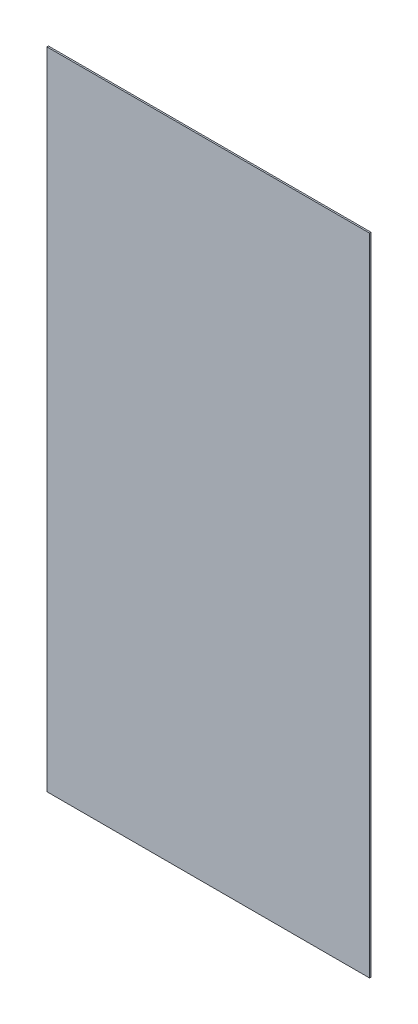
ISO-10303-21;
HEADER;
FILE_DESCRIPTION(('STEP AP214'),'2;1');
FILE_NAME('part.step','',(''),(''),'','','');
FILE_SCHEMA(('AUTOMOTIVE_DESIGN { 1 0 10303 214 1 1 1 1 }'));
ENDSEC;
DATA;
#1=APPLICATION_CONTEXT('core data for automotive mechanical design processes');
#2=APPLICATION_PROTOCOL_DEFINITION('international standard','automotive_design',2000,#1);
#3=PRODUCT_CONTEXT('',#1,'mechanical');
#4=PRODUCT('Part','Part','',(#3));
#5=PRODUCT_RELATED_PRODUCT_CATEGORY('part','',(#4));
#6=PRODUCT_DEFINITION_FORMATION('','',#4);
#7=PRODUCT_DEFINITION_CONTEXT('part definition',#1,'design');
#8=PRODUCT_DEFINITION('design','',#6,#7);
#9=PRODUCT_DEFINITION_SHAPE('','',#8);
#10=(LENGTH_UNIT() NAMED_UNIT(*) SI_UNIT(.MILLI.,.METRE.));
#11=(NAMED_UNIT(*) PLANE_ANGLE_UNIT() SI_UNIT($,.RADIAN.));
#12=(NAMED_UNIT(*) SI_UNIT($,.STERADIAN.) SOLID_ANGLE_UNIT());
#13=UNCERTAINTY_MEASURE_WITH_UNIT(LENGTH_MEASURE(1.E-05),#10,'distance_accuracy_value','');
#14=(GEOMETRIC_REPRESENTATION_CONTEXT(3) GLOBAL_UNCERTAINTY_ASSIGNED_CONTEXT((#13)) GLOBAL_UNIT_ASSIGNED_CONTEXT((#10,
#11,#12)) REPRESENTATION_CONTEXT('',''));
#15=CARTESIAN_POINT('',(0.,0.,0.));
#16=DIRECTION('',(0.,0.,1.));
#17=DIRECTION('',(1.,0.,0.));
#18=AXIS2_PLACEMENT_3D('',#15,#16,#17);
#19=CARTESIAN_POINT('',(0.,0.,2.8575));
#20=DIRECTION('',(1.,0.,0.));
#21=DIRECTION('',(0.,0.,-1.));
#22=AXIS2_PLACEMENT_3D('',#19,#20,#21);
#23=PLANE('',#22);
#24=DIRECTION('',(0.,-1.,0.));
#25=VECTOR('',#24,1.);
#26=CARTESIAN_POINT('',(0.,0.,0.));
#27=LINE('',#26,#25);
#28=CARTESIAN_POINT('',(0.,1219.2,0.));
#29=VERTEX_POINT('',#28);
#30=CARTESIAN_POINT('',(0.,0.,0.));
#31=VERTEX_POINT('',#30);
#32=EDGE_CURVE('E95',#29,#31,#27,.T.);
#33=ORIENTED_EDGE('',*,*,#32,.T.);
#34=DIRECTION('',(0.,0.,-1.));
#35=VECTOR('',#34,1.);
#36=CARTESIAN_POINT('',(0.,0.,2.8575));
#37=LINE('',#36,#35);
#38=CARTESIAN_POINT('',(0.,0.,2.8575));
#39=VERTEX_POINT('',#38);
#40=EDGE_CURVE('E11',#39,#31,#37,.T.);
#41=ORIENTED_EDGE('',*,*,#40,.F.);
#42=DIRECTION('',(0.,-1.,0.));
#43=VECTOR('',#42,1.);
#44=CARTESIAN_POINT('',(0.,0.,2.8575));
#45=LINE('',#44,#43);
#46=CARTESIAN_POINT('',(0.,1219.2,2.8575));
#47=VERTEX_POINT('',#46);
#48=EDGE_CURVE('E83',#47,#39,#45,.T.);
#49=ORIENTED_EDGE('',*,*,#48,.F.);
#50=DIRECTION('',(0.,0.,-1.));
#51=VECTOR('',#50,1.);
#52=CARTESIAN_POINT('',(0.,1219.2,2.8575));
#53=LINE('',#52,#51);
#54=EDGE_CURVE('E91',#47,#29,#53,.T.);
#55=ORIENTED_EDGE('',*,*,#54,.T.);
#56=EDGE_LOOP('',(#33,#41,#49,#55));
#57=FACE_BOUND('',#56,.T.);
#58=ADVANCED_FACE('F32',(#57),#23,.F.);
#59=CARTESIAN_POINT('',(0.,0.,2.8575));
#60=DIRECTION('',(0.,1.,0.));
#61=DIRECTION('',(0.,0.,1.));
#62=AXIS2_PLACEMENT_3D('',#59,#60,#61);
#63=PLANE('',#62);
#64=DIRECTION('',(1.,0.,0.));
#65=VECTOR('',#64,1.);
#66=CARTESIAN_POINT('',(0.,0.,0.));
#67=LINE('',#66,#65);
#68=CARTESIAN_POINT('',(609.6,0.,0.));
#69=VERTEX_POINT('',#68);
#70=EDGE_CURVE('E87',#31,#69,#67,.T.);
#71=ORIENTED_EDGE('',*,*,#70,.T.);
#72=DIRECTION('',(0.,0.,-1.));
#73=VECTOR('',#72,1.);
#74=CARTESIAN_POINT('',(609.6,0.,2.8575));
#75=LINE('',#74,#73);
#76=CARTESIAN_POINT('',(609.6,0.,2.8575));
#77=VERTEX_POINT('',#76);
#78=EDGE_CURVE('E40',#77,#69,#75,.T.);
#79=ORIENTED_EDGE('',*,*,#78,.F.);
#80=DIRECTION('',(1.,0.,0.));
#81=VECTOR('',#80,1.);
#82=CARTESIAN_POINT('',(0.,0.,2.8575));
#83=LINE('',#82,#81);
#84=EDGE_CURVE('E78',#39,#77,#83,.T.);
#85=ORIENTED_EDGE('',*,*,#84,.F.);
#86=ORIENTED_EDGE('',*,*,#40,.T.);
#87=EDGE_LOOP('',(#71,#79,#85,#86));
#88=FACE_BOUND('',#87,.T.);
#89=ADVANCED_FACE('F86',(#88),#63,.F.);
#90=CARTESIAN_POINT('',(609.6,0.,2.8575));
#91=DIRECTION('',(-1.,0.,0.));
#92=DIRECTION('',(0.,0.,1.));
#93=AXIS2_PLACEMENT_3D('',#90,#91,#92);
#94=PLANE('',#93);
#95=DIRECTION('',(0.,1.,0.));
#96=VECTOR('',#95,1.);
#97=CARTESIAN_POINT('',(609.6,0.,0.));
#98=LINE('',#97,#96);
#99=CARTESIAN_POINT('',(609.6,1219.2,0.));
#100=VERTEX_POINT('',#99);
#101=EDGE_CURVE('E65',#69,#100,#98,.T.);
#102=ORIENTED_EDGE('',*,*,#101,.T.);
#103=DIRECTION('',(0.,0.,-1.));
#104=VECTOR('',#103,1.);
#105=CARTESIAN_POINT('',(609.6,1219.2,2.8575));
#106=LINE('',#105,#104);
#107=CARTESIAN_POINT('',(609.6,1219.2,2.8575));
#108=VERTEX_POINT('',#107);
#109=EDGE_CURVE('E88',#108,#100,#106,.T.);
#110=ORIENTED_EDGE('',*,*,#109,.F.);
#111=DIRECTION('',(0.,1.,0.));
#112=VECTOR('',#111,1.);
#113=CARTESIAN_POINT('',(609.6,0.,2.8575));
#114=LINE('',#113,#112);
#115=EDGE_CURVE('E81',#77,#108,#114,.T.);
#116=ORIENTED_EDGE('',*,*,#115,.F.);
#117=ORIENTED_EDGE('',*,*,#78,.T.);
#118=EDGE_LOOP('',(#102,#110,#116,#117));
#119=FACE_BOUND('',#118,.T.);
#120=ADVANCED_FACE('F89',(#119),#94,.F.);
#121=CARTESIAN_POINT('',(0.,1219.2,2.8575));
#122=DIRECTION('',(0.,-1.,0.));
#123=DIRECTION('',(0.,0.,-1.));
#124=AXIS2_PLACEMENT_3D('',#121,#122,#123);
#125=PLANE('',#124);
#126=DIRECTION('',(-1.,0.,0.));
#127=VECTOR('',#126,1.);
#128=CARTESIAN_POINT('',(0.,1219.2,0.));
#129=LINE('',#128,#127);
#130=EDGE_CURVE('E71',#100,#29,#129,.T.);
#131=ORIENTED_EDGE('',*,*,#130,.T.);
#132=ORIENTED_EDGE('',*,*,#54,.F.);
#133=DIRECTION('',(-1.,0.,0.));
#134=VECTOR('',#133,1.);
#135=CARTESIAN_POINT('',(0.,1219.2,2.8575));
#136=LINE('',#135,#134);
#137=EDGE_CURVE('E48',#108,#47,#136,.T.);
#138=ORIENTED_EDGE('',*,*,#137,.F.);
#139=ORIENTED_EDGE('',*,*,#109,.T.);
#140=EDGE_LOOP('',(#131,#132,#138,#139));
#141=FACE_BOUND('',#140,.T.);
#142=ADVANCED_FACE('F102',(#141),#125,.F.);
#143=CARTESIAN_POINT('',(0.,0.,2.8575));
#144=DIRECTION('',(0.,0.,-1.));
#145=DIRECTION('',(-1.,0.,0.));
#146=AXIS2_PLACEMENT_3D('',#143,#144,#145);
#147=PLANE('',#146);
#148=ORIENTED_EDGE('',*,*,#48,.T.);
#149=ORIENTED_EDGE('',*,*,#84,.T.);
#150=ORIENTED_EDGE('',*,*,#115,.T.);
#151=ORIENTED_EDGE('',*,*,#137,.T.);
#152=EDGE_LOOP('',(#148,#149,#150,#151));
#153=FACE_BOUND('',#152,.T.);
#154=ADVANCED_FACE('F79',(#153),#147,.F.);
#155=CARTESIAN_POINT('',(0.,0.,0.));
#156=DIRECTION('',(0.,0.,-1.));
#157=DIRECTION('',(-1.,0.,0.));
#158=AXIS2_PLACEMENT_3D('',#155,#156,#157);
#159=PLANE('',#158);
#160=ORIENTED_EDGE('',*,*,#32,.F.);
#161=ORIENTED_EDGE('',*,*,#130,.F.);
#162=ORIENTED_EDGE('',*,*,#101,.F.);
#163=ORIENTED_EDGE('',*,*,#70,.F.);
#164=EDGE_LOOP('',(#160,#161,#162,#163));
#165=FACE_BOUND('',#164,.T.);
#166=ADVANCED_FACE('F105',(#165),#159,.T.);
#167=CLOSED_SHELL('',(#58,#89,#120,#142,#154,#166));
#168=MANIFOLD_SOLID_BREP('B2',#167);
#169=ADVANCED_BREP_SHAPE_REPRESENTATION('',(#18,#168),#14);
#170=SHAPE_DEFINITION_REPRESENTATION(#9,#169);
ENDSEC;
END-ISO-10303-21;
